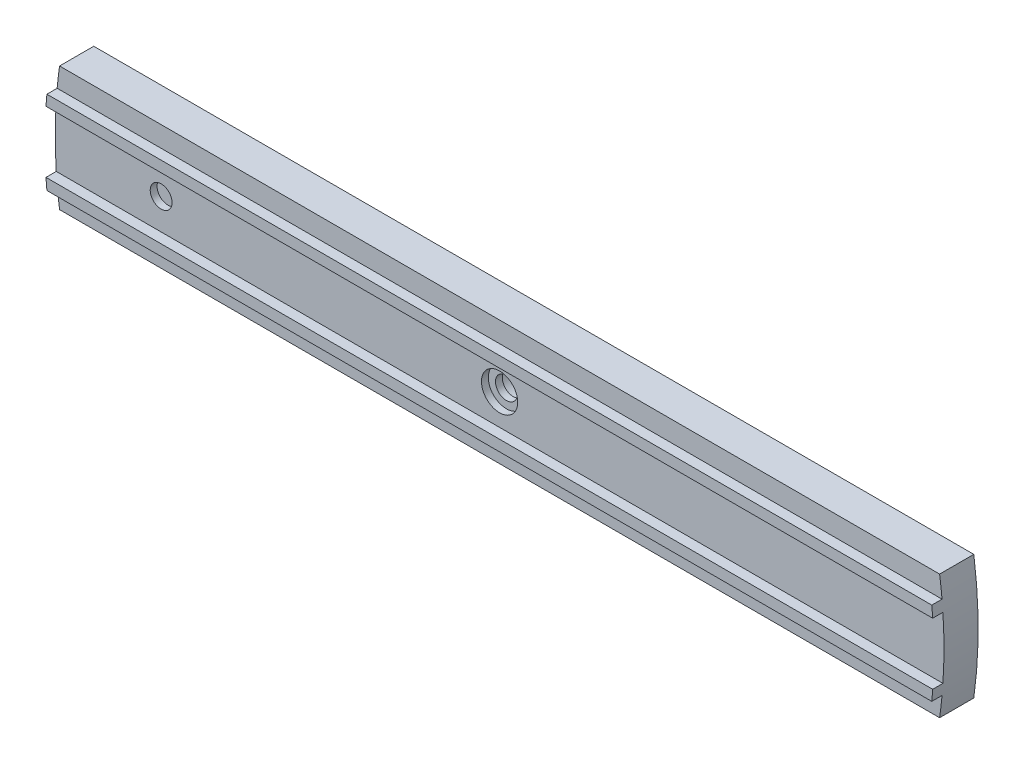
ISO-10303-21;
HEADER;
FILE_DESCRIPTION(('STEP AP214'),'2;1');
FILE_NAME('part.step','',(''),(''),'','','');
FILE_SCHEMA(('AUTOMOTIVE_DESIGN { 1 0 10303 214 1 1 1 1 }'));
ENDSEC;
DATA;
#1=APPLICATION_CONTEXT('core data for automotive mechanical design processes');
#2=APPLICATION_PROTOCOL_DEFINITION('international standard','automotive_design',2000,#1);
#3=PRODUCT_CONTEXT('',#1,'mechanical');
#4=PRODUCT('Part','Part','',(#3));
#5=PRODUCT_RELATED_PRODUCT_CATEGORY('part','',(#4));
#6=PRODUCT_DEFINITION_FORMATION('','',#4);
#7=PRODUCT_DEFINITION_CONTEXT('part definition',#1,'design');
#8=PRODUCT_DEFINITION('design','',#6,#7);
#9=PRODUCT_DEFINITION_SHAPE('','',#8);
#10=(LENGTH_UNIT() NAMED_UNIT(*) SI_UNIT(.MILLI.,.METRE.));
#11=(NAMED_UNIT(*) PLANE_ANGLE_UNIT() SI_UNIT($,.RADIAN.));
#12=(NAMED_UNIT(*) SI_UNIT($,.STERADIAN.) SOLID_ANGLE_UNIT());
#13=UNCERTAINTY_MEASURE_WITH_UNIT(LENGTH_MEASURE(1.E-05),#10,'distance_accuracy_value','');
#14=(GEOMETRIC_REPRESENTATION_CONTEXT(3) GLOBAL_UNCERTAINTY_ASSIGNED_CONTEXT((#13)) GLOBAL_UNIT_ASSIGNED_CONTEXT((#10,
#11,#12)) REPRESENTATION_CONTEXT('',''));
#15=CARTESIAN_POINT('',(0.,0.,0.));
#16=DIRECTION('',(0.,0.,1.));
#17=DIRECTION('',(1.,0.,0.));
#18=AXIS2_PLACEMENT_3D('',#15,#16,#17);
#19=CARTESIAN_POINT('',(0.,0.,-5.));
#20=DIRECTION('',(0.,0.,1.));
#21=DIRECTION('',(1.,0.,0.));
#22=AXIS2_PLACEMENT_3D('',#19,#20,#21);
#23=CYLINDRICAL_SURFACE('',#22,1.6);
#24=CARTESIAN_POINT('',(0.,0.,-2.));
#25=DIRECTION('',(0.,0.,1.));
#26=DIRECTION('',(1.,0.,0.));
#27=AXIS2_PLACEMENT_3D('',#24,#25,#26);
#28=CIRCLE('',#27,1.6);
#29=CARTESIAN_POINT('',(1.6,0.,-2.));
#30=VERTEX_POINT('',#29);
#31=EDGE_CURVE('E177',#30,#30,#28,.F.);
#32=ORIENTED_EDGE('',*,*,#31,.T.);
#33=EDGE_LOOP('',(#32));
#34=FACE_BOUND('',#33,.T.);
#35=CARTESIAN_POINT('',(0.,0.,-1.));
#36=DIRECTION('',(0.,0.,1.));
#37=DIRECTION('',(1.,0.,0.));
#38=AXIS2_PLACEMENT_3D('',#35,#36,#37);
#39=CIRCLE('',#38,1.6);
#40=CARTESIAN_POINT('',(1.6,0.,-1.));
#41=VERTEX_POINT('',#40);
#42=EDGE_CURVE('E55',#41,#41,#39,.F.);
#43=ORIENTED_EDGE('',*,*,#42,.F.);
#44=EDGE_LOOP('',(#43));
#45=FACE_BOUND('',#44,.T.);
#46=ADVANCED_FACE('F51',(#34,#45),#23,.F.);
#47=CARTESIAN_POINT('',(0.,0.,0.));
#48=DIRECTION('',(0.,0.,1.));
#49=DIRECTION('',(1.,0.,0.));
#50=AXIS2_PLACEMENT_3D('',#47,#48,#49);
#51=PLANE('',#50);
#52=CARTESIAN_POINT('',(0.,0.,0.));
#53=DIRECTION('',(0.,0.,-1.));
#54=DIRECTION('',(-1.,0.,0.));
#55=AXIS2_PLACEMENT_3D('',#52,#53,#54);
#56=CIRCLE('',#55,65.);
#57=CARTESIAN_POINT('',(64.7131362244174,-6.1,0.));
#58=VERTEX_POINT('',#57);
#59=CARTESIAN_POINT('',(64.3598477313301,-9.09999999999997,0.));
#60=VERTEX_POINT('',#59);
#61=EDGE_CURVE('E222',#58,#60,#56,.T.);
#62=ORIENTED_EDGE('',*,*,#61,.F.);
#63=DIRECTION('',(1.,0.,0.));
#64=VECTOR('',#63,1.);
#65=CARTESIAN_POINT('',(0.,-6.1,0.));
#66=LINE('',#65,#64);
#67=CARTESIAN_POINT('',(-64.7131362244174,-6.1,0.));
#68=VERTEX_POINT('',#67);
#69=EDGE_CURVE('E164',#68,#58,#66,.T.);
#70=ORIENTED_EDGE('',*,*,#69,.F.);
#71=CARTESIAN_POINT('',(0.,0.,0.));
#72=DIRECTION('',(0.,0.,1.));
#73=DIRECTION('',(1.,0.,0.));
#74=AXIS2_PLACEMENT_3D('',#71,#72,#73);
#75=CIRCLE('',#74,65.);
#76=CARTESIAN_POINT('',(-64.3598477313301,-9.1,0.));
#77=VERTEX_POINT('',#76);
#78=EDGE_CURVE('E202',#68,#77,#75,.T.);
#79=ORIENTED_EDGE('',*,*,#78,.T.);
#80=DIRECTION('',(1.,0.,0.));
#81=VECTOR('',#80,1.);
#82=CARTESIAN_POINT('',(-64.3598477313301,-9.1,0.));
#83=LINE('',#82,#81);
#84=EDGE_CURVE('E218',#77,#60,#83,.T.);
#85=ORIENTED_EDGE('',*,*,#84,.T.);
#86=EDGE_LOOP('',(#62,#70,#79,#85));
#87=FACE_BOUND('',#86,.T.);
#88=ADVANCED_FACE('F277',(#87),#51,.T.);
#89=CARTESIAN_POINT('',(-64.3598477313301,9.1,0.));
#90=VERTEX_POINT('',#89);
#91=CARTESIAN_POINT('',(-64.7131362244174,6.1,0.));
#92=VERTEX_POINT('',#91);
#93=EDGE_CURVE('E215',#90,#92,#75,.T.);
#94=ORIENTED_EDGE('',*,*,#93,.T.);
#95=DIRECTION('',(1.,0.,0.));
#96=VECTOR('',#95,1.);
#97=CARTESIAN_POINT('',(0.,6.1,0.));
#98=LINE('',#97,#96);
#99=CARTESIAN_POINT('',(64.7131362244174,6.1,0.));
#100=VERTEX_POINT('',#99);
#101=EDGE_CURVE('E155',#92,#100,#98,.T.);
#102=ORIENTED_EDGE('',*,*,#101,.T.);
#103=CARTESIAN_POINT('',(64.3598477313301,9.1,0.));
#104=VERTEX_POINT('',#103);
#105=EDGE_CURVE('E223',#104,#100,#56,.T.);
#106=ORIENTED_EDGE('',*,*,#105,.F.);
#107=DIRECTION('',(1.,0.,0.));
#108=VECTOR('',#107,1.);
#109=CARTESIAN_POINT('',(-64.3598477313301,9.1,0.));
#110=LINE('',#109,#108);
#111=EDGE_CURVE('E207',#90,#104,#110,.T.);
#112=ORIENTED_EDGE('',*,*,#111,.F.);
#113=EDGE_LOOP('',(#94,#102,#106,#112));
#114=FACE_BOUND('',#113,.T.);
#115=ADVANCED_FACE('F278',(#114),#51,.T.);
#116=CARTESIAN_POINT('',(0.,0.,-5.));
#117=DIRECTION('',(0.,0.,1.));
#118=DIRECTION('',(1.,0.,0.));
#119=AXIS2_PLACEMENT_3D('',#116,#117,#118);
#120=CYLINDRICAL_SURFACE('',#119,65.);
#121=ORIENTED_EDGE('',*,*,#93,.F.);
#122=DIRECTION('',(0.,0.,1.));
#123=VECTOR('',#122,1.);
#124=CARTESIAN_POINT('',(-64.3598477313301,9.1,-5.));
#125=LINE('',#124,#123);
#126=CARTESIAN_POINT('',(-64.3598477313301,9.1,-5.));
#127=VERTEX_POINT('',#126);
#128=EDGE_CURVE('E12',#127,#90,#125,.T.);
#129=ORIENTED_EDGE('',*,*,#128,.F.);
#130=CARTESIAN_POINT('',(0.,0.,-5.));
#131=DIRECTION('',(0.,0.,1.));
#132=DIRECTION('',(1.,0.,0.));
#133=AXIS2_PLACEMENT_3D('',#130,#131,#132);
#134=CIRCLE('',#133,65.);
#135=CARTESIAN_POINT('',(-64.3598477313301,-9.1,-5.));
#136=VERTEX_POINT('',#135);
#137=EDGE_CURVE('E203',#127,#136,#134,.T.);
#138=ORIENTED_EDGE('',*,*,#137,.T.);
#139=DIRECTION('',(0.,0.,1.));
#140=VECTOR('',#139,1.);
#141=CARTESIAN_POINT('',(-64.3598477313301,-9.1,-5.));
#142=LINE('',#141,#140);
#143=EDGE_CURVE('E214',#136,#77,#142,.T.);
#144=ORIENTED_EDGE('',*,*,#143,.T.);
#145=ORIENTED_EDGE('',*,*,#78,.F.);
#146=DIRECTION('',(0.,0.,-1.));
#147=VECTOR('',#146,1.);
#148=CARTESIAN_POINT('',(-64.7131362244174,-6.1,1.5));
#149=LINE('',#148,#147);
#150=CARTESIAN_POINT('',(-64.7131362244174,-6.1,1.5));
#151=VERTEX_POINT('',#150);
#152=EDGE_CURVE('E68',#151,#68,#149,.T.);
#153=ORIENTED_EDGE('',*,*,#152,.F.);
#154=CARTESIAN_POINT('',(0.,0.,1.5));
#155=DIRECTION('',(0.,0.,1.));
#156=DIRECTION('',(1.,0.,0.));
#157=AXIS2_PLACEMENT_3D('',#154,#155,#156);
#158=CIRCLE('',#157,65.);
#159=CARTESIAN_POINT('',(-64.8440436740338,-4.5,1.5));
#160=VERTEX_POINT('',#159);
#161=EDGE_CURVE('E168',#160,#151,#158,.T.);
#162=ORIENTED_EDGE('',*,*,#161,.F.);
#163=DIRECTION('',(0.,0.,-1.));
#164=VECTOR('',#163,1.);
#165=CARTESIAN_POINT('',(-64.8440436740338,-4.5,1.5));
#166=LINE('',#165,#164);
#167=CARTESIAN_POINT('',(-64.8440436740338,-4.5,0.));
#168=VERTEX_POINT('',#167);
#169=EDGE_CURVE('E156',#160,#168,#166,.T.);
#170=ORIENTED_EDGE('',*,*,#169,.T.);
#171=CARTESIAN_POINT('',(-64.8440436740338,4.5,0.));
#172=VERTEX_POINT('',#171);
#173=EDGE_CURVE('E219',#172,#168,#75,.T.);
#174=ORIENTED_EDGE('',*,*,#173,.F.);
#175=DIRECTION('',(0.,0.,-1.));
#176=VECTOR('',#175,1.);
#177=CARTESIAN_POINT('',(-64.8440436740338,4.5,1.5));
#178=LINE('',#177,#176);
#179=CARTESIAN_POINT('',(-64.8440436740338,4.5,1.5));
#180=VERTEX_POINT('',#179);
#181=EDGE_CURVE('E197',#180,#172,#178,.T.);
#182=ORIENTED_EDGE('',*,*,#181,.F.);
#183=CARTESIAN_POINT('',(0.,0.,1.5));
#184=DIRECTION('',(0.,0.,1.));
#185=DIRECTION('',(1.,0.,0.));
#186=AXIS2_PLACEMENT_3D('',#183,#184,#185);
#187=CIRCLE('',#186,65.);
#188=CARTESIAN_POINT('',(-64.7131362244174,6.1,1.5));
#189=VERTEX_POINT('',#188);
#190=EDGE_CURVE('E188',#189,#180,#187,.T.);
#191=ORIENTED_EDGE('',*,*,#190,.F.);
#192=DIRECTION('',(0.,0.,-1.));
#193=VECTOR('',#192,1.);
#194=CARTESIAN_POINT('',(-64.7131362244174,6.1,1.5));
#195=LINE('',#194,#193);
#196=EDGE_CURVE('E199',#189,#92,#195,.T.);
#197=ORIENTED_EDGE('',*,*,#196,.T.);
#198=EDGE_LOOP('',(#121,#129,#138,#144,#145,#153,#162,#170,#174,#182,#191,#197));
#199=FACE_BOUND('',#198,.T.);
#200=ADVANCED_FACE('F53',(#199),#120,.T.);
#201=CARTESIAN_POINT('',(-64.3598477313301,9.1,-5.));
#202=DIRECTION('',(0.,-1.,0.));
#203=DIRECTION('',(0.,0.,-1.));
#204=AXIS2_PLACEMENT_3D('',#201,#202,#203);
#205=PLANE('',#204);
#206=ORIENTED_EDGE('',*,*,#111,.T.);
#207=DIRECTION('',(0.,0.,1.));
#208=VECTOR('',#207,1.);
#209=CARTESIAN_POINT('',(64.3598477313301,9.1,-5.));
#210=LINE('',#209,#208);
#211=CARTESIAN_POINT('',(64.3598477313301,9.1,-5.));
#212=VERTEX_POINT('',#211);
#213=EDGE_CURVE('E60',#212,#104,#210,.T.);
#214=ORIENTED_EDGE('',*,*,#213,.F.);
#215=DIRECTION('',(1.,0.,0.));
#216=VECTOR('',#215,1.);
#217=CARTESIAN_POINT('',(-64.3598477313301,9.1,-5.));
#218=LINE('',#217,#216);
#219=EDGE_CURVE('E212',#127,#212,#218,.T.);
#220=ORIENTED_EDGE('',*,*,#219,.F.);
#221=ORIENTED_EDGE('',*,*,#128,.T.);
#222=EDGE_LOOP('',(#206,#214,#220,#221));
#223=FACE_BOUND('',#222,.T.);
#224=ADVANCED_FACE('F320',(#223),#205,.F.);
#225=CARTESIAN_POINT('',(0.,0.,-5.));
#226=DIRECTION('',(0.,0.,1.));
#227=DIRECTION('',(1.,0.,0.));
#228=AXIS2_PLACEMENT_3D('',#225,#226,#227);
#229=CYLINDRICAL_SURFACE('',#228,65.);
#230=ORIENTED_EDGE('',*,*,#105,.T.);
#231=DIRECTION('',(0.,0.,-1.));
#232=VECTOR('',#231,1.);
#233=CARTESIAN_POINT('',(64.7131362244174,6.1,1.5));
#234=LINE('',#233,#232);
#235=CARTESIAN_POINT('',(64.7131362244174,6.1,1.5));
#236=VERTEX_POINT('',#235);
#237=EDGE_CURVE('E76',#236,#100,#234,.T.);
#238=ORIENTED_EDGE('',*,*,#237,.F.);
#239=CARTESIAN_POINT('',(0.,0.,1.5));
#240=DIRECTION('',(0.,0.,1.));
#241=DIRECTION('',(1.,0.,0.));
#242=AXIS2_PLACEMENT_3D('',#239,#240,#241);
#243=CIRCLE('',#242,65.);
#244=CARTESIAN_POINT('',(64.8440436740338,4.5,1.5));
#245=VERTEX_POINT('',#244);
#246=EDGE_CURVE('E182',#236,#245,#243,.F.);
#247=ORIENTED_EDGE('',*,*,#246,.T.);
#248=DIRECTION('',(0.,0.,-1.));
#249=VECTOR('',#248,1.);
#250=CARTESIAN_POINT('',(64.8440436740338,4.5,1.5));
#251=LINE('',#250,#249);
#252=CARTESIAN_POINT('',(64.8440436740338,4.5,0.));
#253=VERTEX_POINT('',#252);
#254=EDGE_CURVE('E192',#245,#253,#251,.T.);
#255=ORIENTED_EDGE('',*,*,#254,.T.);
#256=CARTESIAN_POINT('',(64.8440436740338,-4.5,0.));
#257=VERTEX_POINT('',#256);
#258=EDGE_CURVE('E150',#253,#257,#56,.T.);
#259=ORIENTED_EDGE('',*,*,#258,.T.);
#260=DIRECTION('',(0.,0.,-1.));
#261=VECTOR('',#260,1.);
#262=CARTESIAN_POINT('',(64.8440436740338,-4.5,1.5));
#263=LINE('',#262,#261);
#264=CARTESIAN_POINT('',(64.8440436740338,-4.5,1.5));
#265=VERTEX_POINT('',#264);
#266=EDGE_CURVE('E144',#265,#257,#263,.T.);
#267=ORIENTED_EDGE('',*,*,#266,.F.);
#268=CARTESIAN_POINT('',(0.,0.,1.5));
#269=DIRECTION('',(0.,0.,1.));
#270=DIRECTION('',(1.,0.,0.));
#271=AXIS2_PLACEMENT_3D('',#268,#269,#270);
#272=CIRCLE('',#271,65.);
#273=CARTESIAN_POINT('',(64.7131362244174,-6.1,1.5));
#274=VERTEX_POINT('',#273);
#275=EDGE_CURVE('E148',#265,#274,#272,.F.);
#276=ORIENTED_EDGE('',*,*,#275,.T.);
#277=DIRECTION('',(0.,0.,-1.));
#278=VECTOR('',#277,1.);
#279=CARTESIAN_POINT('',(64.7131362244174,-6.1,1.5));
#280=LINE('',#279,#278);
#281=EDGE_CURVE('E174',#274,#58,#280,.T.);
#282=ORIENTED_EDGE('',*,*,#281,.T.);
#283=ORIENTED_EDGE('',*,*,#61,.T.);
#284=DIRECTION('',(0.,0.,1.));
#285=VECTOR('',#284,1.);
#286=CARTESIAN_POINT('',(64.3598477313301,-9.09999999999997,-5.));
#287=LINE('',#286,#285);
#288=CARTESIAN_POINT('',(64.3598477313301,-9.09999999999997,-5.));
#289=VERTEX_POINT('',#288);
#290=EDGE_CURVE('E228',#289,#60,#287,.T.);
#291=ORIENTED_EDGE('',*,*,#290,.F.);
#292=CARTESIAN_POINT('',(0.,0.,-5.));
#293=DIRECTION('',(0.,0.,-1.));
#294=DIRECTION('',(-1.,0.,0.));
#295=AXIS2_PLACEMENT_3D('',#292,#293,#294);
#296=CIRCLE('',#295,65.);
#297=EDGE_CURVE('E210',#212,#289,#296,.T.);
#298=ORIENTED_EDGE('',*,*,#297,.F.);
#299=ORIENTED_EDGE('',*,*,#213,.T.);
#300=EDGE_LOOP('',(#230,#238,#247,#255,#259,#267,#276,#282,#283,#291,#298,#299));
#301=FACE_BOUND('',#300,.T.);
#302=ADVANCED_FACE('F147',(#301),#229,.T.);
#303=CARTESIAN_POINT('',(-64.3598477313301,-9.1,-5.));
#304=DIRECTION('',(0.,-1.,0.));
#305=DIRECTION('',(0.,0.,-1.));
#306=AXIS2_PLACEMENT_3D('',#303,#304,#305);
#307=PLANE('',#306);
#308=ORIENTED_EDGE('',*,*,#84,.F.);
#309=ORIENTED_EDGE('',*,*,#143,.F.);
#310=DIRECTION('',(1.,0.,0.));
#311=VECTOR('',#310,1.);
#312=CARTESIAN_POINT('',(-64.3598477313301,-9.1,-5.));
#313=LINE('',#312,#311);
#314=EDGE_CURVE('E206',#136,#289,#313,.T.);
#315=ORIENTED_EDGE('',*,*,#314,.T.);
#316=ORIENTED_EDGE('',*,*,#290,.T.);
#317=EDGE_LOOP('',(#308,#309,#315,#316));
#318=FACE_BOUND('',#317,.T.);
#319=ADVANCED_FACE('F294',(#318),#307,.T.);
#320=CARTESIAN_POINT('',(0.,0.,-5.));
#321=DIRECTION('',(0.,0.,1.));
#322=DIRECTION('',(1.,0.,0.));
#323=AXIS2_PLACEMENT_3D('',#320,#321,#322);
#324=PLANE('',#323);
#325=CARTESIAN_POINT('',(-49.5,0.,-5.));
#326=DIRECTION('',(0.,0.,1.));
#327=DIRECTION('',(1.,0.,0.));
#328=AXIS2_PLACEMENT_3D('',#325,#326,#327);
#329=CIRCLE('',#328,1.6);
#330=CARTESIAN_POINT('',(-47.9,0.,-5.));
#331=VERTEX_POINT('',#330);
#332=EDGE_CURVE('E244',#331,#331,#329,.T.);
#333=ORIENTED_EDGE('',*,*,#332,.T.);
#334=EDGE_LOOP('',(#333));
#335=FACE_BOUND('',#334,.T.);
#336=CARTESIAN_POINT('',(0.,0.,-5.));
#337=DIRECTION('',(0.,0.,1.));
#338=DIRECTION('',(1.,0.,0.));
#339=AXIS2_PLACEMENT_3D('',#336,#337,#338);
#340=CIRCLE('',#339,2.65);
#341=CARTESIAN_POINT('',(2.65,0.,-5.));
#342=VERTEX_POINT('',#341);
#343=EDGE_CURVE('E237',#342,#342,#340,.T.);
#344=ORIENTED_EDGE('',*,*,#343,.T.);
#345=EDGE_LOOP('',(#344));
#346=FACE_BOUND('',#345,.T.);
#347=ORIENTED_EDGE('',*,*,#137,.F.);
#348=ORIENTED_EDGE('',*,*,#219,.T.);
#349=ORIENTED_EDGE('',*,*,#297,.T.);
#350=ORIENTED_EDGE('',*,*,#314,.F.);
#351=EDGE_LOOP('',(#347,#348,#349,#350));
#352=FACE_BOUND('',#351,.T.);
#353=ADVANCED_FACE('F275',(#335,#346,#352),#324,.F.);
#354=CARTESIAN_POINT('',(-49.5,0.,0.));
#355=DIRECTION('',(0.,0.,1.));
#356=DIRECTION('',(1.,0.,0.));
#357=AXIS2_PLACEMENT_3D('',#354,#355,#356);
#358=CIRCLE('',#357,1.6);
#359=CARTESIAN_POINT('',(-47.9,0.,0.));
#360=VERTEX_POINT('',#359);
#361=EDGE_CURVE('E256',#360,#360,#358,.T.);
#362=ORIENTED_EDGE('',*,*,#361,.F.);
#363=EDGE_LOOP('',(#362));
#364=FACE_BOUND('',#363,.T.);
#365=CARTESIAN_POINT('',(0.,0.,0.));
#366=DIRECTION('',(0.,0.,1.));
#367=DIRECTION('',(1.,0.,0.));
#368=AXIS2_PLACEMENT_3D('',#365,#366,#367);
#369=CIRCLE('',#368,2.65);
#370=CARTESIAN_POINT('',(2.65,0.,0.));
#371=VERTEX_POINT('',#370);
#372=EDGE_CURVE('E249',#371,#371,#369,.T.);
#373=ORIENTED_EDGE('',*,*,#372,.F.);
#374=EDGE_LOOP('',(#373));
#375=FACE_BOUND('',#374,.T.);
#376=DIRECTION('',(1.,0.,0.));
#377=VECTOR('',#376,1.);
#378=CARTESIAN_POINT('',(0.,-4.5,0.));
#379=LINE('',#378,#377);
#380=EDGE_CURVE('E175',#168,#257,#379,.T.);
#381=ORIENTED_EDGE('',*,*,#380,.T.);
#382=ORIENTED_EDGE('',*,*,#258,.F.);
#383=DIRECTION('',(1.,0.,0.));
#384=VECTOR('',#383,1.);
#385=CARTESIAN_POINT('',(0.,4.5,0.));
#386=LINE('',#385,#384);
#387=EDGE_CURVE('E186',#172,#253,#386,.T.);
#388=ORIENTED_EDGE('',*,*,#387,.F.);
#389=ORIENTED_EDGE('',*,*,#173,.T.);
#390=EDGE_LOOP('',(#381,#382,#388,#389));
#391=FACE_BOUND('',#390,.T.);
#392=ADVANCED_FACE('F271',(#364,#375,#391),#51,.T.);
#393=CARTESIAN_POINT('',(0.,6.1,1.5));
#394=DIRECTION('',(0.,1.,0.));
#395=DIRECTION('',(0.,0.,1.));
#396=AXIS2_PLACEMENT_3D('',#393,#394,#395);
#397=PLANE('',#396);
#398=ORIENTED_EDGE('',*,*,#101,.F.);
#399=ORIENTED_EDGE('',*,*,#196,.F.);
#400=DIRECTION('',(1.,0.,0.));
#401=VECTOR('',#400,1.);
#402=CARTESIAN_POINT('',(0.,6.1,1.5));
#403=LINE('',#402,#401);
#404=EDGE_CURVE('E185',#189,#236,#403,.T.);
#405=ORIENTED_EDGE('',*,*,#404,.T.);
#406=ORIENTED_EDGE('',*,*,#237,.T.);
#407=EDGE_LOOP('',(#398,#399,#405,#406));
#408=FACE_BOUND('',#407,.T.);
#409=ADVANCED_FACE('F274',(#408),#397,.T.);
#410=CARTESIAN_POINT('',(0.,4.5,1.5));
#411=DIRECTION('',(0.,1.,0.));
#412=DIRECTION('',(0.,0.,1.));
#413=AXIS2_PLACEMENT_3D('',#410,#411,#412);
#414=PLANE('',#413);
#415=ORIENTED_EDGE('',*,*,#387,.T.);
#416=ORIENTED_EDGE('',*,*,#254,.F.);
#417=DIRECTION('',(1.,0.,0.));
#418=VECTOR('',#417,1.);
#419=CARTESIAN_POINT('',(0.,4.5,1.5));
#420=LINE('',#419,#418);
#421=EDGE_CURVE('E190',#180,#245,#420,.T.);
#422=ORIENTED_EDGE('',*,*,#421,.F.);
#423=ORIENTED_EDGE('',*,*,#181,.T.);
#424=EDGE_LOOP('',(#415,#416,#422,#423));
#425=FACE_BOUND('',#424,.T.);
#426=ADVANCED_FACE('F349',(#425),#414,.F.);
#427=CARTESIAN_POINT('',(0.,0.,1.5));
#428=DIRECTION('',(0.,0.,1.));
#429=DIRECTION('',(1.,0.,0.));
#430=AXIS2_PLACEMENT_3D('',#427,#428,#429);
#431=PLANE('',#430);
#432=ORIENTED_EDGE('',*,*,#246,.F.);
#433=ORIENTED_EDGE('',*,*,#404,.F.);
#434=ORIENTED_EDGE('',*,*,#190,.T.);
#435=ORIENTED_EDGE('',*,*,#421,.T.);
#436=EDGE_LOOP('',(#432,#433,#434,#435));
#437=FACE_BOUND('',#436,.T.);
#438=ADVANCED_FACE('F306',(#437),#431,.T.);
#439=CARTESIAN_POINT('',(0.,-4.5,1.5));
#440=DIRECTION('',(0.,1.,0.));
#441=DIRECTION('',(0.,0.,1.));
#442=AXIS2_PLACEMENT_3D('',#439,#440,#441);
#443=PLANE('',#442);
#444=ORIENTED_EDGE('',*,*,#380,.F.);
#445=ORIENTED_EDGE('',*,*,#169,.F.);
#446=DIRECTION('',(1.,0.,0.));
#447=VECTOR('',#446,1.);
#448=CARTESIAN_POINT('',(0.,-4.5,1.5));
#449=LINE('',#448,#447);
#450=EDGE_CURVE('E161',#160,#265,#449,.T.);
#451=ORIENTED_EDGE('',*,*,#450,.T.);
#452=ORIENTED_EDGE('',*,*,#266,.T.);
#453=EDGE_LOOP('',(#444,#445,#451,#452));
#454=FACE_BOUND('',#453,.T.);
#455=ADVANCED_FACE('F166',(#454),#443,.T.);
#456=CARTESIAN_POINT('',(0.,-6.1,1.5));
#457=DIRECTION('',(0.,1.,0.));
#458=DIRECTION('',(0.,0.,1.));
#459=AXIS2_PLACEMENT_3D('',#456,#457,#458);
#460=PLANE('',#459);
#461=ORIENTED_EDGE('',*,*,#69,.T.);
#462=ORIENTED_EDGE('',*,*,#281,.F.);
#463=DIRECTION('',(1.,0.,0.));
#464=VECTOR('',#463,1.);
#465=CARTESIAN_POINT('',(0.,-6.1,1.5));
#466=LINE('',#465,#464);
#467=EDGE_CURVE('E162',#151,#274,#466,.T.);
#468=ORIENTED_EDGE('',*,*,#467,.F.);
#469=ORIENTED_EDGE('',*,*,#152,.T.);
#470=EDGE_LOOP('',(#461,#462,#468,#469));
#471=FACE_BOUND('',#470,.T.);
#472=ADVANCED_FACE('F297',(#471),#460,.F.);
#473=CARTESIAN_POINT('',(0.,0.,1.5));
#474=DIRECTION('',(0.,0.,1.));
#475=DIRECTION('',(1.,0.,0.));
#476=AXIS2_PLACEMENT_3D('',#473,#474,#475);
#477=PLANE('',#476);
#478=ORIENTED_EDGE('',*,*,#275,.F.);
#479=ORIENTED_EDGE('',*,*,#450,.F.);
#480=ORIENTED_EDGE('',*,*,#161,.T.);
#481=ORIENTED_EDGE('',*,*,#467,.T.);
#482=EDGE_LOOP('',(#478,#479,#480,#481));
#483=FACE_BOUND('',#482,.T.);
#484=ADVANCED_FACE('F160',(#483),#477,.T.);
#485=CARTESIAN_POINT('',(0.,0.,-2.));
#486=DIRECTION('',(0.,0.,1.));
#487=DIRECTION('',(1.,0.,0.));
#488=AXIS2_PLACEMENT_3D('',#485,#486,#487);
#489=PLANE('',#488);
#490=CARTESIAN_POINT('',(0.,0.,-2.));
#491=DIRECTION('',(0.,0.,1.));
#492=DIRECTION('',(1.,0.,0.));
#493=AXIS2_PLACEMENT_3D('',#490,#491,#492);
#494=CIRCLE('',#493,2.65);
#495=CARTESIAN_POINT('',(2.65,0.,-2.));
#496=VERTEX_POINT('',#495);
#497=EDGE_CURVE('E233',#496,#496,#494,.T.);
#498=ORIENTED_EDGE('',*,*,#497,.F.);
#499=EDGE_LOOP('',(#498));
#500=FACE_BOUND('',#499,.T.);
#501=ORIENTED_EDGE('',*,*,#31,.F.);
#502=EDGE_LOOP('',(#501));
#503=FACE_BOUND('',#502,.T.);
#504=ADVANCED_FACE('F304',(#500,#503),#489,.F.);
#505=CARTESIAN_POINT('',(0.,0.,-2.));
#506=DIRECTION('',(0.,0.,-1.));
#507=DIRECTION('',(-1.,0.,0.));
#508=AXIS2_PLACEMENT_3D('',#505,#506,#507);
#509=CYLINDRICAL_SURFACE('',#508,2.65);
#510=ORIENTED_EDGE('',*,*,#497,.T.);
#511=EDGE_LOOP('',(#510));
#512=FACE_BOUND('',#511,.T.);
#513=ORIENTED_EDGE('',*,*,#343,.F.);
#514=EDGE_LOOP('',(#513));
#515=FACE_BOUND('',#514,.T.);
#516=ADVANCED_FACE('F383',(#512,#515),#509,.F.);
#517=CARTESIAN_POINT('',(-49.5,0.,-2.));
#518=DIRECTION('',(0.,0.,-1.));
#519=DIRECTION('',(-1.,0.,0.));
#520=AXIS2_PLACEMENT_3D('',#517,#518,#519);
#521=CYLINDRICAL_SURFACE('',#520,1.6);
#522=CARTESIAN_POINT('',(-49.5,0.,-2.));
#523=DIRECTION('',(0.,0.,1.));
#524=DIRECTION('',(1.,0.,0.));
#525=AXIS2_PLACEMENT_3D('',#522,#523,#524);
#526=CIRCLE('',#525,1.6);
#527=CARTESIAN_POINT('',(-47.9,0.,-2.));
#528=VERTEX_POINT('',#527);
#529=EDGE_CURVE('E242',#528,#528,#526,.T.);
#530=ORIENTED_EDGE('',*,*,#529,.T.);
#531=EDGE_LOOP('',(#530));
#532=FACE_BOUND('',#531,.T.);
#533=ORIENTED_EDGE('',*,*,#332,.F.);
#534=EDGE_LOOP('',(#533));
#535=FACE_BOUND('',#534,.T.);
#536=ADVANCED_FACE('F390',(#532,#535),#521,.F.);
#537=CARTESIAN_POINT('',(0.,0.,-2.));
#538=DIRECTION('',(0.,0.,1.));
#539=DIRECTION('',(1.,0.,0.));
#540=AXIS2_PLACEMENT_3D('',#537,#538,#539);
#541=PLANE('',#540);
#542=ORIENTED_EDGE('',*,*,#529,.F.);
#543=EDGE_LOOP('',(#542));
#544=FACE_BOUND('',#543,.T.);
#545=ADVANCED_FACE('F397',(#544),#541,.F.);
#546=CARTESIAN_POINT('',(0.,0.,-1.));
#547=DIRECTION('',(0.,0.,1.));
#548=DIRECTION('',(1.,0.,0.));
#549=AXIS2_PLACEMENT_3D('',#546,#547,#548);
#550=PLANE('',#549);
#551=CARTESIAN_POINT('',(0.,0.,-1.));
#552=DIRECTION('',(0.,0.,1.));
#553=DIRECTION('',(1.,0.,0.));
#554=AXIS2_PLACEMENT_3D('',#551,#552,#553);
#555=CIRCLE('',#554,2.65);
#556=CARTESIAN_POINT('',(2.65,0.,-1.));
#557=VERTEX_POINT('',#556);
#558=EDGE_CURVE('E252',#557,#557,#555,.T.);
#559=ORIENTED_EDGE('',*,*,#558,.T.);
#560=EDGE_LOOP('',(#559));
#561=FACE_BOUND('',#560,.T.);
#562=ORIENTED_EDGE('',*,*,#42,.T.);
#563=EDGE_LOOP('',(#562));
#564=FACE_BOUND('',#563,.T.);
#565=ADVANCED_FACE('F405',(#561,#564),#550,.T.);
#566=CARTESIAN_POINT('',(0.,0.,-1.));
#567=DIRECTION('',(0.,0.,1.));
#568=DIRECTION('',(1.,0.,0.));
#569=AXIS2_PLACEMENT_3D('',#566,#567,#568);
#570=CYLINDRICAL_SURFACE('',#569,2.65);
#571=ORIENTED_EDGE('',*,*,#558,.F.);
#572=EDGE_LOOP('',(#571));
#573=FACE_BOUND('',#572,.T.);
#574=ORIENTED_EDGE('',*,*,#372,.T.);
#575=EDGE_LOOP('',(#574));
#576=FACE_BOUND('',#575,.T.);
#577=ADVANCED_FACE('F267',(#573,#576),#570,.F.);
#578=CARTESIAN_POINT('',(-49.5,0.,-1.));
#579=DIRECTION('',(0.,0.,1.));
#580=DIRECTION('',(1.,0.,0.));
#581=AXIS2_PLACEMENT_3D('',#578,#579,#580);
#582=CYLINDRICAL_SURFACE('',#581,1.6);
#583=CARTESIAN_POINT('',(-49.5,0.,-1.));
#584=DIRECTION('',(0.,0.,1.));
#585=DIRECTION('',(1.,0.,0.));
#586=AXIS2_PLACEMENT_3D('',#583,#584,#585);
#587=CIRCLE('',#586,1.6);
#588=CARTESIAN_POINT('',(-47.9,0.,-1.));
#589=VERTEX_POINT('',#588);
#590=EDGE_CURVE('E253',#589,#589,#587,.T.);
#591=ORIENTED_EDGE('',*,*,#590,.F.);
#592=EDGE_LOOP('',(#591));
#593=FACE_BOUND('',#592,.T.);
#594=ORIENTED_EDGE('',*,*,#361,.T.);
#595=EDGE_LOOP('',(#594));
#596=FACE_BOUND('',#595,.T.);
#597=ADVANCED_FACE('F264',(#593,#596),#582,.F.);
#598=CARTESIAN_POINT('',(-49.5,0.,-1.));
#599=DIRECTION('',(0.,0.,1.));
#600=DIRECTION('',(1.,0.,0.));
#601=AXIS2_PLACEMENT_3D('',#598,#599,#600);
#602=PLANE('',#601);
#603=ORIENTED_EDGE('',*,*,#590,.T.);
#604=EDGE_LOOP('',(#603));
#605=FACE_BOUND('',#604,.T.);
#606=ADVANCED_FACE('F262',(#605),#602,.T.);
#607=CLOSED_SHELL('',(#46,#88,#115,#200,#224,#302,#319,#353,#392,#409,#426,#438,#455,#472,#484,
#504,#516,#536,#545,#565,#577,#597,#606));
#608=MANIFOLD_SOLID_BREP('B2',#607);
#609=ADVANCED_BREP_SHAPE_REPRESENTATION('',(#18,#608),#14);
#610=SHAPE_DEFINITION_REPRESENTATION(#9,#609);
ENDSEC;
END-ISO-10303-21;
